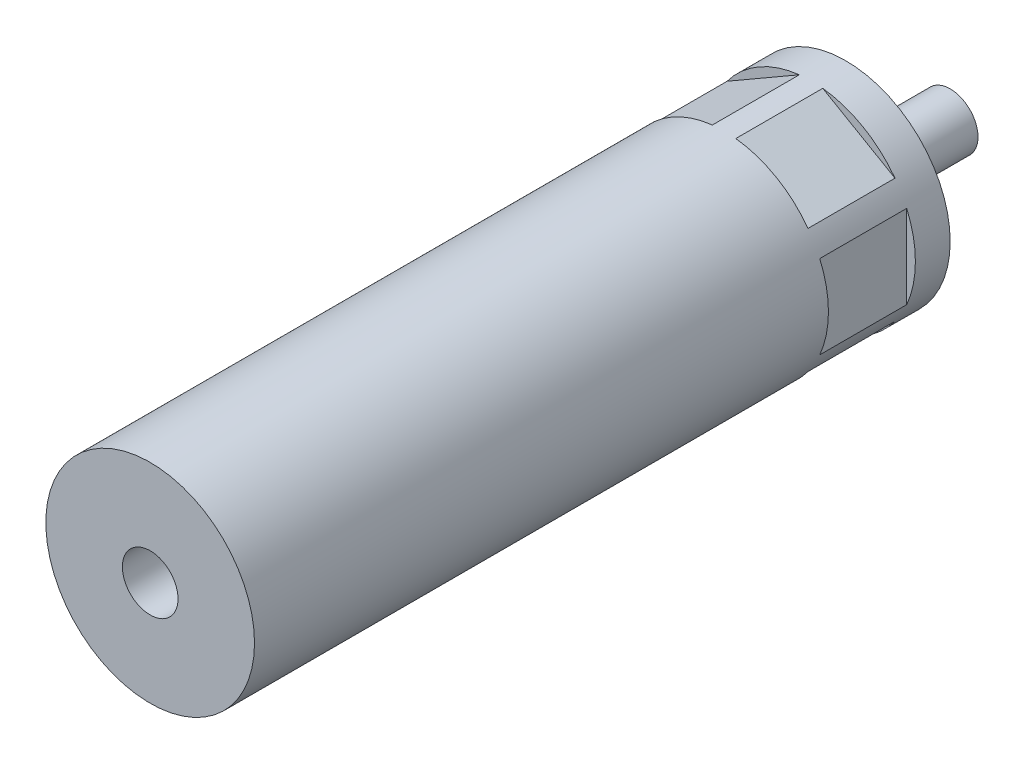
ISO-10303-21;
HEADER;
FILE_DESCRIPTION(('STEP AP214'),'2;1');
FILE_NAME('part.step','',(''),(''),'','','');
FILE_SCHEMA(('AUTOMOTIVE_DESIGN { 1 0 10303 214 1 1 1 1 }'));
ENDSEC;
DATA;
#1=APPLICATION_CONTEXT('core data for automotive mechanical design processes');
#2=APPLICATION_PROTOCOL_DEFINITION('international standard','automotive_design',2000,#1);
#3=PRODUCT_CONTEXT('',#1,'mechanical');
#4=PRODUCT('Part','Part','',(#3));
#5=PRODUCT_RELATED_PRODUCT_CATEGORY('part','',(#4));
#6=PRODUCT_DEFINITION_FORMATION('','',#4);
#7=PRODUCT_DEFINITION_CONTEXT('part definition',#1,'design');
#8=PRODUCT_DEFINITION('design','',#6,#7);
#9=PRODUCT_DEFINITION_SHAPE('','',#8);
#10=(LENGTH_UNIT() NAMED_UNIT(*) SI_UNIT(.MILLI.,.METRE.));
#11=(NAMED_UNIT(*) PLANE_ANGLE_UNIT() SI_UNIT($,.RADIAN.));
#12=(NAMED_UNIT(*) SI_UNIT($,.STERADIAN.) SOLID_ANGLE_UNIT());
#13=UNCERTAINTY_MEASURE_WITH_UNIT(LENGTH_MEASURE(1.E-05),#10,'distance_accuracy_value','');
#14=(GEOMETRIC_REPRESENTATION_CONTEXT(3) GLOBAL_UNCERTAINTY_ASSIGNED_CONTEXT((#13)) GLOBAL_UNIT_ASSIGNED_CONTEXT((#10,
#11,#12)) REPRESENTATION_CONTEXT('',''));
#15=CARTESIAN_POINT('',(0.,0.,0.));
#16=DIRECTION('',(0.,0.,1.));
#17=DIRECTION('',(1.,0.,0.));
#18=AXIS2_PLACEMENT_3D('',#15,#16,#17);
#19=CARTESIAN_POINT('',(0.,0.,80.));
#20=DIRECTION('',(0.,0.,1.));
#21=DIRECTION('',(1.,0.,0.));
#22=AXIS2_PLACEMENT_3D('',#19,#20,#21);
#23=CYLINDRICAL_SURFACE('',#22,30.);
#24=CARTESIAN_POINT('',(0.,0.,10.));
#25=DIRECTION('',(0.,0.,1.));
#26=DIRECTION('',(1.,0.,0.));
#27=AXIS2_PLACEMENT_3D('',#24,#25,#26);
#28=CIRCLE('',#27,30.);
#29=CARTESIAN_POINT('',(-24.1332798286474,-17.8209091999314,10.));
#30=VERTEX_POINT('',#29);
#31=CARTESIAN_POINT('',(-3.36672017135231,-29.8104880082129,10.));
#32=VERTEX_POINT('',#31);
#33=EDGE_CURVE('E152',#30,#32,#28,.T.);
#34=ORIENTED_EDGE('',*,*,#33,.F.);
#35=DIRECTION('',(0.,0.,1.));
#36=VECTOR('',#35,1.);
#37=CARTESIAN_POINT('',(-24.1332798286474,-17.8209091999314,80.));
#38=LINE('',#37,#36);
#39=CARTESIAN_POINT('',(-24.1332798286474,-17.8209091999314,35.));
#40=VERTEX_POINT('',#39);
#41=EDGE_CURVE('E9',#30,#40,#38,.T.);
#42=ORIENTED_EDGE('',*,*,#41,.T.);
#43=CARTESIAN_POINT('',(0.,0.,35.));
#44=DIRECTION('',(0.,0.,1.));
#45=DIRECTION('',(1.,0.,0.));
#46=AXIS2_PLACEMENT_3D('',#43,#44,#45);
#47=CIRCLE('',#46,30.);
#48=CARTESIAN_POINT('',(-3.3667201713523,-29.8104880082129,35.));
#49=VERTEX_POINT('',#48);
#50=EDGE_CURVE('E22',#40,#49,#47,.T.);
#51=ORIENTED_EDGE('',*,*,#50,.T.);
#52=DIRECTION('',(0.,0.,1.));
#53=VECTOR('',#52,1.);
#54=CARTESIAN_POINT('',(-3.36672017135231,-29.8104880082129,80.));
#55=LINE('',#54,#53);
#56=EDGE_CURVE('E149',#49,#32,#55,.F.);
#57=ORIENTED_EDGE('',*,*,#56,.T.);
#58=EDGE_LOOP('',(#34,#42,#51,#57));
#59=FACE_BOUND('',#58,.T.);
#60=DIRECTION('',(0.,0.,1.));
#61=VECTOR('',#60,1.);
#62=CARTESIAN_POINT('',(27.5,11.9895788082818,80.));
#63=LINE('',#62,#61);
#64=CARTESIAN_POINT('',(27.5,11.9895788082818,10.));
#65=VERTEX_POINT('',#64);
#66=CARTESIAN_POINT('',(27.5,11.9895788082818,35.));
#67=VERTEX_POINT('',#66);
#68=EDGE_CURVE('E142',#65,#67,#63,.T.);
#69=ORIENTED_EDGE('',*,*,#68,.F.);
#70=CARTESIAN_POINT('',(27.5,-11.9895788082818,10.));
#71=VERTEX_POINT('',#70);
#72=EDGE_CURVE('E141',#71,#65,#28,.T.);
#73=ORIENTED_EDGE('',*,*,#72,.F.);
#74=DIRECTION('',(0.,0.,1.));
#75=VECTOR('',#74,1.);
#76=CARTESIAN_POINT('',(27.5,-11.9895788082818,80.));
#77=LINE('',#76,#75);
#78=CARTESIAN_POINT('',(27.5,-11.9895788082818,35.));
#79=VERTEX_POINT('',#78);
#80=EDGE_CURVE('E138',#79,#71,#77,.F.);
#81=ORIENTED_EDGE('',*,*,#80,.F.);
#82=EDGE_CURVE('E145',#79,#67,#47,.T.);
#83=ORIENTED_EDGE('',*,*,#82,.T.);
#84=EDGE_LOOP('',(#69,#73,#81,#83));
#85=FACE_BOUND('',#84,.T.);
#86=CARTESIAN_POINT('',(24.1332798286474,17.8209091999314,10.));
#87=VERTEX_POINT('',#86);
#88=CARTESIAN_POINT('',(3.36672017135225,29.8104880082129,10.));
#89=VERTEX_POINT('',#88);
#90=EDGE_CURVE('E134',#87,#89,#28,.T.);
#91=ORIENTED_EDGE('',*,*,#90,.F.);
#92=DIRECTION('',(0.,0.,1.));
#93=VECTOR('',#92,1.);
#94=CARTESIAN_POINT('',(24.1332798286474,17.8209091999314,80.));
#95=LINE('',#94,#93);
#96=CARTESIAN_POINT('',(24.1332798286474,17.8209091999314,35.));
#97=VERTEX_POINT('',#96);
#98=EDGE_CURVE('E135',#87,#97,#95,.T.);
#99=ORIENTED_EDGE('',*,*,#98,.T.);
#100=CARTESIAN_POINT('',(3.36672017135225,29.8104880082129,35.));
#101=VERTEX_POINT('',#100);
#102=EDGE_CURVE('E139',#97,#101,#47,.T.);
#103=ORIENTED_EDGE('',*,*,#102,.T.);
#104=DIRECTION('',(0.,0.,1.));
#105=VECTOR('',#104,1.);
#106=CARTESIAN_POINT('',(3.36672017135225,29.8104880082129,80.));
#107=LINE('',#106,#105);
#108=EDGE_CURVE('E131',#101,#89,#107,.F.);
#109=ORIENTED_EDGE('',*,*,#108,.T.);
#110=EDGE_LOOP('',(#91,#99,#103,#109));
#111=FACE_BOUND('',#110,.T.);
#112=CARTESIAN_POINT('',(0.,0.,0.));
#113=DIRECTION('',(0.,0.,1.));
#114=DIRECTION('',(1.,0.,0.));
#115=AXIS2_PLACEMENT_3D('',#112,#113,#114);
#116=CIRCLE('',#115,30.);
#117=CARTESIAN_POINT('',(30.,0.,0.));
#118=VERTEX_POINT('',#117);
#119=EDGE_CURVE('E210',#118,#118,#116,.T.);
#120=ORIENTED_EDGE('',*,*,#119,.T.);
#121=EDGE_LOOP('',(#120));
#122=FACE_BOUND('',#121,.T.);
#123=CARTESIAN_POINT('',(0.,0.,200.));
#124=DIRECTION('',(0.,0.,1.));
#125=DIRECTION('',(1.,0.,0.));
#126=AXIS2_PLACEMENT_3D('',#123,#124,#125);
#127=CIRCLE('',#126,30.);
#128=CARTESIAN_POINT('',(30.,0.,200.));
#129=VERTEX_POINT('',#128);
#130=EDGE_CURVE('E213',#129,#129,#127,.T.);
#131=ORIENTED_EDGE('',*,*,#130,.F.);
#132=EDGE_LOOP('',(#131));
#133=FACE_BOUND('',#132,.T.);
#134=CARTESIAN_POINT('',(-27.5,11.9895788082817,10.));
#135=VERTEX_POINT('',#134);
#136=CARTESIAN_POINT('',(-27.5,-11.9895788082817,10.));
#137=VERTEX_POINT('',#136);
#138=EDGE_CURVE('E111',#135,#137,#28,.T.);
#139=ORIENTED_EDGE('',*,*,#138,.F.);
#140=DIRECTION('',(0.,0.,1.));
#141=VECTOR('',#140,1.);
#142=CARTESIAN_POINT('',(-27.5,11.9895788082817,80.));
#143=LINE('',#142,#141);
#144=CARTESIAN_POINT('',(-27.5,11.9895788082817,35.));
#145=VERTEX_POINT('',#144);
#146=EDGE_CURVE('E110',#135,#145,#143,.T.);
#147=ORIENTED_EDGE('',*,*,#146,.T.);
#148=CARTESIAN_POINT('',(-27.5,-11.9895788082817,35.));
#149=VERTEX_POINT('',#148);
#150=EDGE_CURVE('E103',#145,#149,#47,.T.);
#151=ORIENTED_EDGE('',*,*,#150,.T.);
#152=DIRECTION('',(0.,0.,1.));
#153=VECTOR('',#152,1.);
#154=CARTESIAN_POINT('',(-27.5,-11.9895788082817,80.));
#155=LINE('',#154,#153);
#156=EDGE_CURVE('E117',#149,#137,#155,.F.);
#157=ORIENTED_EDGE('',*,*,#156,.T.);
#158=EDGE_LOOP('',(#139,#147,#151,#157));
#159=FACE_BOUND('',#158,.T.);
#160=DIRECTION('',(0.,0.,1.));
#161=VECTOR('',#160,1.);
#162=CARTESIAN_POINT('',(-24.1332798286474,17.8209091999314,80.));
#163=LINE('',#162,#161);
#164=CARTESIAN_POINT('',(-24.1332798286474,17.8209091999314,10.));
#165=VERTEX_POINT('',#164);
#166=CARTESIAN_POINT('',(-24.1332798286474,17.8209091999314,35.));
#167=VERTEX_POINT('',#166);
#168=EDGE_CURVE('E129',#165,#167,#163,.T.);
#169=ORIENTED_EDGE('',*,*,#168,.F.);
#170=CARTESIAN_POINT('',(-3.36672017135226,29.8104880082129,10.));
#171=VERTEX_POINT('',#170);
#172=EDGE_CURVE('E125',#171,#165,#28,.T.);
#173=ORIENTED_EDGE('',*,*,#172,.F.);
#174=DIRECTION('',(0.,0.,1.));
#175=VECTOR('',#174,1.);
#176=CARTESIAN_POINT('',(-3.36672017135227,29.8104880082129,80.));
#177=LINE('',#176,#175);
#178=CARTESIAN_POINT('',(-3.36672017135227,29.8104880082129,35.));
#179=VERTEX_POINT('',#178);
#180=EDGE_CURVE('E123',#179,#171,#177,.F.);
#181=ORIENTED_EDGE('',*,*,#180,.F.);
#182=EDGE_CURVE('E113',#179,#167,#47,.T.);
#183=ORIENTED_EDGE('',*,*,#182,.T.);
#184=EDGE_LOOP('',(#169,#173,#181,#183));
#185=FACE_BOUND('',#184,.T.);
#186=DIRECTION('',(0.,0.,1.));
#187=VECTOR('',#186,1.);
#188=CARTESIAN_POINT('',(24.1332798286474,-17.8209091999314,80.));
#189=LINE('',#188,#187);
#190=CARTESIAN_POINT('',(24.1332798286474,-17.8209091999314,10.));
#191=VERTEX_POINT('',#190);
#192=CARTESIAN_POINT('',(24.1332798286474,-17.8209091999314,35.));
#193=VERTEX_POINT('',#192);
#194=EDGE_CURVE('E148',#191,#193,#189,.T.);
#195=ORIENTED_EDGE('',*,*,#194,.F.);
#196=CARTESIAN_POINT('',(3.36672017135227,-29.8104880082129,10.));
#197=VERTEX_POINT('',#196);
#198=EDGE_CURVE('E147',#197,#191,#28,.T.);
#199=ORIENTED_EDGE('',*,*,#198,.F.);
#200=DIRECTION('',(0.,0.,1.));
#201=VECTOR('',#200,1.);
#202=CARTESIAN_POINT('',(3.36672017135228,-29.8104880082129,80.));
#203=LINE('',#202,#201);
#204=CARTESIAN_POINT('',(3.36672017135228,-29.8104880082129,35.));
#205=VERTEX_POINT('',#204);
#206=EDGE_CURVE('E144',#205,#197,#203,.F.);
#207=ORIENTED_EDGE('',*,*,#206,.F.);
#208=EDGE_CURVE('E150',#205,#193,#47,.T.);
#209=ORIENTED_EDGE('',*,*,#208,.T.);
#210=EDGE_LOOP('',(#195,#199,#207,#209));
#211=FACE_BOUND('',#210,.T.);
#212=ADVANCED_FACE('F14',(#59,#85,#111,#122,#133,#159,#185,#211),#23,.T.);
#213=CARTESIAN_POINT('',(0.,0.,-30.));
#214=DIRECTION('',(0.,0.,1.));
#215=DIRECTION('',(1.,0.,0.));
#216=AXIS2_PLACEMENT_3D('',#213,#214,#215);
#217=PLANE('',#216);
#218=CARTESIAN_POINT('',(0.,0.,-30.));
#219=DIRECTION('',(0.,0.,1.));
#220=DIRECTION('',(1.,0.,0.));
#221=AXIS2_PLACEMENT_3D('',#218,#219,#220);
#222=CIRCLE('',#221,8.);
#223=CARTESIAN_POINT('',(8.,0.,-30.));
#224=VERTEX_POINT('',#223);
#225=EDGE_CURVE('E190',#224,#224,#222,.T.);
#226=ORIENTED_EDGE('',*,*,#225,.F.);
#227=EDGE_LOOP('',(#226));
#228=FACE_BOUND('',#227,.T.);
#229=ADVANCED_FACE('F16',(#228),#217,.F.);
#230=CARTESIAN_POINT('',(0.,0.,80.));
#231=DIRECTION('',(0.,0.,1.));
#232=DIRECTION('',(1.,0.,0.));
#233=AXIS2_PLACEMENT_3D('',#230,#231,#232);
#234=CYLINDRICAL_SURFACE('',#233,8.);
#235=CARTESIAN_POINT('',(0.,0.,165.));
#236=DIRECTION('',(0.,0.,1.));
#237=DIRECTION('',(1.,0.,0.));
#238=AXIS2_PLACEMENT_3D('',#235,#236,#237);
#239=CIRCLE('',#238,8.);
#240=CARTESIAN_POINT('',(8.,0.,165.));
#241=VERTEX_POINT('',#240);
#242=EDGE_CURVE('E245',#241,#241,#239,.T.);
#243=ORIENTED_EDGE('',*,*,#242,.F.);
#244=EDGE_LOOP('',(#243));
#245=FACE_BOUND('',#244,.T.);
#246=CARTESIAN_POINT('',(0.,0.,200.));
#247=DIRECTION('',(0.,0.,1.));
#248=DIRECTION('',(1.,0.,0.));
#249=AXIS2_PLACEMENT_3D('',#246,#247,#248);
#250=CIRCLE('',#249,8.);
#251=CARTESIAN_POINT('',(8.,0.,200.));
#252=VERTEX_POINT('',#251);
#253=EDGE_CURVE('E159',#252,#252,#250,.T.);
#254=ORIENTED_EDGE('',*,*,#253,.T.);
#255=EDGE_LOOP('',(#254));
#256=FACE_BOUND('',#255,.T.);
#257=ADVANCED_FACE('F219',(#245,#256),#234,.F.);
#258=CARTESIAN_POINT('',(30.,0.,200.));
#259=DIRECTION('',(0.,0.,-1.));
#260=DIRECTION('',(-1.,0.,0.));
#261=AXIS2_PLACEMENT_3D('',#258,#259,#260);
#262=PLANE('',#261);
#263=ORIENTED_EDGE('',*,*,#253,.F.);
#264=EDGE_LOOP('',(#263));
#265=FACE_BOUND('',#264,.T.);
#266=ORIENTED_EDGE('',*,*,#130,.T.);
#267=EDGE_LOOP('',(#266));
#268=FACE_BOUND('',#267,.T.);
#269=ADVANCED_FACE('F221',(#265,#268),#262,.F.);
#270=CARTESIAN_POINT('',(30.,0.,0.));
#271=DIRECTION('',(0.,0.,-1.));
#272=DIRECTION('',(-1.,0.,0.));
#273=AXIS2_PLACEMENT_3D('',#270,#271,#272);
#274=PLANE('',#273);
#275=CARTESIAN_POINT('',(0.,0.,0.));
#276=DIRECTION('',(0.,0.,1.));
#277=DIRECTION('',(1.,0.,0.));
#278=AXIS2_PLACEMENT_3D('',#275,#276,#277);
#279=CIRCLE('',#278,6.5);
#280=CARTESIAN_POINT('',(6.5,0.,0.));
#281=VERTEX_POINT('',#280);
#282=EDGE_CURVE('E207',#281,#281,#279,.T.);
#283=ORIENTED_EDGE('',*,*,#282,.T.);
#284=EDGE_LOOP('',(#283));
#285=FACE_BOUND('',#284,.T.);
#286=ORIENTED_EDGE('',*,*,#119,.F.);
#287=EDGE_LOOP('',(#286));
#288=FACE_BOUND('',#287,.T.);
#289=ADVANCED_FACE('F224',(#285,#288),#274,.T.);
#290=CARTESIAN_POINT('',(0.,0.,80.));
#291=DIRECTION('',(0.,0.,1.));
#292=DIRECTION('',(1.,0.,0.));
#293=AXIS2_PLACEMENT_3D('',#290,#291,#292);
#294=CYLINDRICAL_SURFACE('',#293,6.5);
#295=CARTESIAN_POINT('',(0.,0.,-4.));
#296=DIRECTION('',(0.,0.,1.));
#297=DIRECTION('',(1.,0.,0.));
#298=AXIS2_PLACEMENT_3D('',#295,#296,#297);
#299=CIRCLE('',#298,6.5);
#300=CARTESIAN_POINT('',(6.5,0.,-4.));
#301=VERTEX_POINT('',#300);
#302=EDGE_CURVE('E204',#301,#301,#299,.T.);
#303=ORIENTED_EDGE('',*,*,#302,.T.);
#304=EDGE_LOOP('',(#303));
#305=FACE_BOUND('',#304,.T.);
#306=ORIENTED_EDGE('',*,*,#282,.F.);
#307=EDGE_LOOP('',(#306));
#308=FACE_BOUND('',#307,.T.);
#309=ADVANCED_FACE('F443',(#305,#308),#294,.T.);
#310=CARTESIAN_POINT('',(6.5,0.,-4.));
#311=DIRECTION('',(0.,0.,1.));
#312=DIRECTION('',(1.,0.,0.));
#313=AXIS2_PLACEMENT_3D('',#310,#311,#312);
#314=PLANE('',#313);
#315=CARTESIAN_POINT('',(0.,0.,-4.));
#316=DIRECTION('',(0.,0.,1.));
#317=DIRECTION('',(1.,0.,0.));
#318=AXIS2_PLACEMENT_3D('',#315,#316,#317);
#319=CIRCLE('',#318,8.);
#320=CARTESIAN_POINT('',(8.,0.,-4.));
#321=VERTEX_POINT('',#320);
#322=EDGE_CURVE('E201',#321,#321,#319,.T.);
#323=ORIENTED_EDGE('',*,*,#322,.T.);
#324=EDGE_LOOP('',(#323));
#325=FACE_BOUND('',#324,.T.);
#326=ORIENTED_EDGE('',*,*,#302,.F.);
#327=EDGE_LOOP('',(#326));
#328=FACE_BOUND('',#327,.T.);
#329=ADVANCED_FACE('F339',(#325,#328),#314,.T.);
#330=CARTESIAN_POINT('',(0.,0.,80.));
#331=DIRECTION('',(0.,0.,1.));
#332=DIRECTION('',(1.,0.,0.));
#333=AXIS2_PLACEMENT_3D('',#330,#331,#332);
#334=CYLINDRICAL_SURFACE('',#333,8.);
#335=ORIENTED_EDGE('',*,*,#322,.F.);
#336=EDGE_LOOP('',(#335));
#337=FACE_BOUND('',#336,.T.);
#338=ORIENTED_EDGE('',*,*,#225,.T.);
#339=EDGE_LOOP('',(#338));
#340=FACE_BOUND('',#339,.T.);
#341=ADVANCED_FACE('F333',(#337,#340),#334,.T.);
#342=CARTESIAN_POINT('',(-27.5,15.8771324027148,35.));
#343=DIRECTION('',(1.,0.,0.));
#344=DIRECTION('',(0.,1.,0.));
#345=AXIS2_PLACEMENT_3D('',#342,#343,#344);
#346=PLANE('',#345);
#347=DIRECTION('',(0.,-1.,0.));
#348=VECTOR('',#347,1.);
#349=CARTESIAN_POINT('',(-27.5,15.8771324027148,10.));
#350=LINE('',#349,#348);
#351=EDGE_CURVE('E247',#135,#137,#350,.T.);
#352=ORIENTED_EDGE('',*,*,#351,.T.);
#353=ORIENTED_EDGE('',*,*,#156,.F.);
#354=DIRECTION('',(0.,-1.,0.));
#355=VECTOR('',#354,1.);
#356=CARTESIAN_POINT('',(-27.5,15.8771324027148,35.));
#357=LINE('',#356,#355);
#358=EDGE_CURVE('E106',#145,#149,#357,.T.);
#359=ORIENTED_EDGE('',*,*,#358,.F.);
#360=ORIENTED_EDGE('',*,*,#146,.F.);
#361=EDGE_LOOP('',(#352,#353,#359,#360));
#362=FACE_BOUND('',#361,.T.);
#363=ADVANCED_FACE('F115',(#362),#346,.F.);
#364=CARTESIAN_POINT('',(0.,0.,10.));
#365=DIRECTION('',(0.,0.,1.));
#366=DIRECTION('',(1.,0.,0.));
#367=AXIS2_PLACEMENT_3D('',#364,#365,#366);
#368=PLANE('',#367);
#369=ORIENTED_EDGE('',*,*,#138,.T.);
#370=ORIENTED_EDGE('',*,*,#351,.F.);
#371=EDGE_LOOP('',(#369,#370));
#372=FACE_BOUND('',#371,.T.);
#373=ADVANCED_FACE('F281',(#372),#368,.T.);
#374=CARTESIAN_POINT('',(0.,0.,35.));
#375=DIRECTION('',(0.,0.,1.));
#376=DIRECTION('',(1.,0.,0.));
#377=AXIS2_PLACEMENT_3D('',#374,#375,#376);
#378=PLANE('',#377);
#379=ORIENTED_EDGE('',*,*,#358,.T.);
#380=ORIENTED_EDGE('',*,*,#150,.F.);
#381=EDGE_LOOP('',(#379,#380));
#382=FACE_BOUND('',#381,.T.);
#383=ADVANCED_FACE('F105',(#382),#378,.F.);
#384=CARTESIAN_POINT('',(-27.5,15.8771324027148,35.));
#385=DIRECTION('',(-0.5,0.866025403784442,0.));
#386=DIRECTION('',(-0.866025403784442,-0.5,0.));
#387=AXIS2_PLACEMENT_3D('',#384,#385,#386);
#388=PLANE('',#387);
#389=ORIENTED_EDGE('',*,*,#168,.T.);
#390=DIRECTION('',(0.866025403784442,0.5,0.));
#391=VECTOR('',#390,1.);
#392=CARTESIAN_POINT('',(-27.5,15.8771324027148,35.));
#393=LINE('',#392,#391);
#394=EDGE_CURVE('E118',#167,#179,#393,.T.);
#395=ORIENTED_EDGE('',*,*,#394,.T.);
#396=ORIENTED_EDGE('',*,*,#180,.T.);
#397=DIRECTION('',(0.866025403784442,0.5,0.));
#398=VECTOR('',#397,1.);
#399=CARTESIAN_POINT('',(-27.5,15.8771324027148,10.));
#400=LINE('',#399,#398);
#401=EDGE_CURVE('E249',#165,#171,#400,.T.);
#402=ORIENTED_EDGE('',*,*,#401,.F.);
#403=EDGE_LOOP('',(#389,#395,#396,#402));
#404=FACE_BOUND('',#403,.T.);
#405=ADVANCED_FACE('F265',(#404),#388,.T.);
#406=ORIENTED_EDGE('',*,*,#172,.T.);
#407=ORIENTED_EDGE('',*,*,#401,.T.);
#408=EDGE_LOOP('',(#406,#407));
#409=FACE_BOUND('',#408,.T.);
#410=ADVANCED_FACE('F259',(#409),#368,.T.);
#411=ORIENTED_EDGE('',*,*,#394,.F.);
#412=ORIENTED_EDGE('',*,*,#182,.F.);
#413=EDGE_LOOP('',(#411,#412));
#414=FACE_BOUND('',#413,.T.);
#415=ADVANCED_FACE('F267',(#414),#378,.F.);
#416=CARTESIAN_POINT('',(27.5,15.8771324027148,35.));
#417=DIRECTION('',(-0.499999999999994,-0.866025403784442,0.));
#418=DIRECTION('',(0.866025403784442,-0.499999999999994,0.));
#419=AXIS2_PLACEMENT_3D('',#416,#417,#418);
#420=PLANE('',#419);
#421=DIRECTION('',(-0.866025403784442,0.499999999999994,0.));
#422=VECTOR('',#421,1.);
#423=CARTESIAN_POINT('',(27.5,15.8771324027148,10.));
#424=LINE('',#423,#422);
#425=EDGE_CURVE('E257',#87,#89,#424,.T.);
#426=ORIENTED_EDGE('',*,*,#425,.T.);
#427=ORIENTED_EDGE('',*,*,#108,.F.);
#428=DIRECTION('',(-0.866025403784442,0.499999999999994,0.));
#429=VECTOR('',#428,1.);
#430=CARTESIAN_POINT('',(27.5,15.8771324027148,35.));
#431=LINE('',#430,#429);
#432=EDGE_CURVE('E192',#97,#101,#431,.T.);
#433=ORIENTED_EDGE('',*,*,#432,.F.);
#434=ORIENTED_EDGE('',*,*,#98,.F.);
#435=EDGE_LOOP('',(#426,#427,#433,#434));
#436=FACE_BOUND('',#435,.T.);
#437=ADVANCED_FACE('F269',(#436),#420,.F.);
#438=ORIENTED_EDGE('',*,*,#90,.T.);
#439=ORIENTED_EDGE('',*,*,#425,.F.);
#440=EDGE_LOOP('',(#438,#439));
#441=FACE_BOUND('',#440,.T.);
#442=ADVANCED_FACE('F277',(#441),#368,.T.);
#443=ORIENTED_EDGE('',*,*,#432,.T.);
#444=ORIENTED_EDGE('',*,*,#102,.F.);
#445=EDGE_LOOP('',(#443,#444));
#446=FACE_BOUND('',#445,.T.);
#447=ADVANCED_FACE('F271',(#446),#378,.F.);
#448=CARTESIAN_POINT('',(27.5,15.8771324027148,35.));
#449=DIRECTION('',(1.,0.,0.));
#450=DIRECTION('',(0.,1.,0.));
#451=AXIS2_PLACEMENT_3D('',#448,#449,#450);
#452=PLANE('',#451);
#453=ORIENTED_EDGE('',*,*,#68,.T.);
#454=DIRECTION('',(0.,-1.,0.));
#455=VECTOR('',#454,1.);
#456=CARTESIAN_POINT('',(27.5,15.8771324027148,35.));
#457=LINE('',#456,#455);
#458=EDGE_CURVE('E187',#67,#79,#457,.T.);
#459=ORIENTED_EDGE('',*,*,#458,.T.);
#460=ORIENTED_EDGE('',*,*,#80,.T.);
#461=DIRECTION('',(0.,-1.,0.));
#462=VECTOR('',#461,1.);
#463=CARTESIAN_POINT('',(27.5,15.8771324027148,10.));
#464=LINE('',#463,#462);
#465=EDGE_CURVE('E256',#65,#71,#464,.T.);
#466=ORIENTED_EDGE('',*,*,#465,.F.);
#467=EDGE_LOOP('',(#453,#459,#460,#466));
#468=FACE_BOUND('',#467,.T.);
#469=ADVANCED_FACE('F286',(#468),#452,.T.);
#470=ORIENTED_EDGE('',*,*,#72,.T.);
#471=ORIENTED_EDGE('',*,*,#465,.T.);
#472=EDGE_LOOP('',(#470,#471));
#473=FACE_BOUND('',#472,.T.);
#474=ADVANCED_FACE('F294',(#473),#368,.T.);
#475=ORIENTED_EDGE('',*,*,#458,.F.);
#476=ORIENTED_EDGE('',*,*,#82,.F.);
#477=EDGE_LOOP('',(#475,#476));
#478=FACE_BOUND('',#477,.T.);
#479=ADVANCED_FACE('F288',(#478),#378,.F.);
#480=CARTESIAN_POINT('',(27.5,-15.8771324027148,35.));
#481=DIRECTION('',(0.5,-0.866025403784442,0.));
#482=DIRECTION('',(0.866025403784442,0.5,0.));
#483=AXIS2_PLACEMENT_3D('',#480,#481,#482);
#484=PLANE('',#483);
#485=ORIENTED_EDGE('',*,*,#194,.T.);
#486=DIRECTION('',(-0.866025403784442,-0.5,0.));
#487=VECTOR('',#486,1.);
#488=CARTESIAN_POINT('',(27.5,-15.8771324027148,35.));
#489=LINE('',#488,#487);
#490=EDGE_CURVE('E37',#193,#205,#489,.T.);
#491=ORIENTED_EDGE('',*,*,#490,.T.);
#492=ORIENTED_EDGE('',*,*,#206,.T.);
#493=DIRECTION('',(-0.866025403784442,-0.5,0.));
#494=VECTOR('',#493,1.);
#495=CARTESIAN_POINT('',(27.5,-15.8771324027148,10.));
#496=LINE('',#495,#494);
#497=EDGE_CURVE('E253',#191,#197,#496,.T.);
#498=ORIENTED_EDGE('',*,*,#497,.F.);
#499=EDGE_LOOP('',(#485,#491,#492,#498));
#500=FACE_BOUND('',#499,.T.);
#501=ADVANCED_FACE('F298',(#500),#484,.T.);
#502=ORIENTED_EDGE('',*,*,#198,.T.);
#503=ORIENTED_EDGE('',*,*,#497,.T.);
#504=EDGE_LOOP('',(#502,#503));
#505=FACE_BOUND('',#504,.T.);
#506=ADVANCED_FACE('F305',(#505),#368,.T.);
#507=ORIENTED_EDGE('',*,*,#490,.F.);
#508=ORIENTED_EDGE('',*,*,#208,.F.);
#509=EDGE_LOOP('',(#507,#508));
#510=FACE_BOUND('',#509,.T.);
#511=ADVANCED_FACE('F185',(#510),#378,.F.);
#512=DIRECTION('',(0.866025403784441,-0.5,0.));
#513=VECTOR('',#512,1.);
#514=CARTESIAN_POINT('',(-27.5,-15.8771324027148,35.));
#515=LINE('',#514,#513);
#516=EDGE_CURVE('E186',#40,#49,#515,.T.);
#517=ORIENTED_EDGE('',*,*,#516,.T.);
#518=ORIENTED_EDGE('',*,*,#50,.F.);
#519=EDGE_LOOP('',(#517,#518));
#520=FACE_BOUND('',#519,.T.);
#521=ADVANCED_FACE('F284',(#520),#378,.F.);
#522=ORIENTED_EDGE('',*,*,#33,.T.);
#523=DIRECTION('',(0.866025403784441,-0.5,0.));
#524=VECTOR('',#523,1.);
#525=CARTESIAN_POINT('',(-27.5,-15.8771324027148,10.));
#526=LINE('',#525,#524);
#527=EDGE_CURVE('E29',#30,#32,#526,.T.);
#528=ORIENTED_EDGE('',*,*,#527,.F.);
#529=EDGE_LOOP('',(#522,#528));
#530=FACE_BOUND('',#529,.T.);
#531=ADVANCED_FACE('F314',(#530),#368,.T.);
#532=CARTESIAN_POINT('',(-27.5,-15.8771324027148,35.));
#533=DIRECTION('',(0.5,0.866025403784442,0.));
#534=DIRECTION('',(-0.866025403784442,0.5,0.));
#535=AXIS2_PLACEMENT_3D('',#532,#533,#534);
#536=PLANE('',#535);
#537=ORIENTED_EDGE('',*,*,#527,.T.);
#538=ORIENTED_EDGE('',*,*,#56,.F.);
#539=ORIENTED_EDGE('',*,*,#516,.F.);
#540=ORIENTED_EDGE('',*,*,#41,.F.);
#541=EDGE_LOOP('',(#537,#538,#539,#540));
#542=FACE_BOUND('',#541,.T.);
#543=ADVANCED_FACE('F321',(#542),#536,.F.);
#544=CARTESIAN_POINT('',(0.,0.,165.));
#545=DIRECTION('',(0.,0.,1.));
#546=DIRECTION('',(1.,0.,0.));
#547=AXIS2_PLACEMENT_3D('',#544,#545,#546);
#548=PLANE('',#547);
#549=ORIENTED_EDGE('',*,*,#242,.T.);
#550=EDGE_LOOP('',(#549));
#551=FACE_BOUND('',#550,.T.);
#552=ADVANCED_FACE('F326',(#551),#548,.T.);
#553=CLOSED_SHELL('',(#212,#229,#257,#269,#289,#309,#329,#341,#363,#373,#383,#405,#410,#415,
#437,#442,#447,#469,#474,#479,#501,#506,#511,#521,#531,#543,#552));
#554=MANIFOLD_SOLID_BREP('B1',#553);
#555=ADVANCED_BREP_SHAPE_REPRESENTATION('',(#18,#554),#14);
#556=SHAPE_DEFINITION_REPRESENTATION(#9,#555);
ENDSEC;
END-ISO-10303-21;
